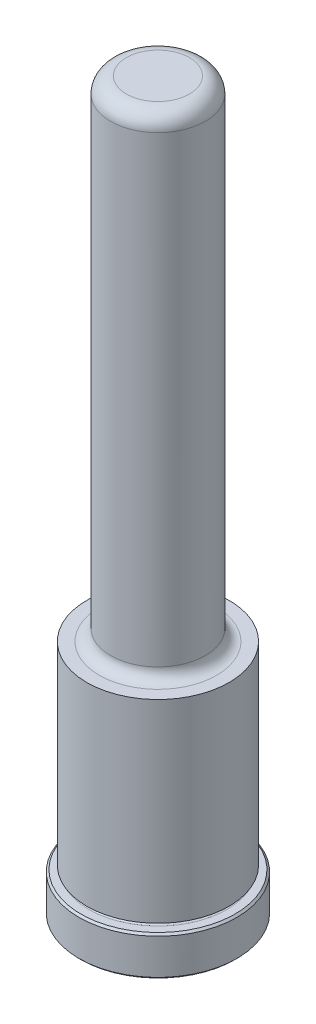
from build123d import *

# Parameters (mm, degrees)
CHAMFER1_SIZE = 0.381
FILLET1_R     = 3.175


with BuildPart() as part:
    # Sketch1 → Revolve1 (revolve)
    with BuildSketch(Plane(origin=(0, 0, 0), x_dir=(0, 0, -1), z_dir=(1, 0, 0)), mode=Mode.PRIVATE) as revolve1_sk:
        with BuildLine():
            Line((0, 0), (15.875, 0))
            Line((15.875, 0), (15.875, 7.9248))
            Line((15.875, 7.9248), (13.8938, 7.9248))
            ThreePointArc((13.8938, 7.9248), (13.5128, 8.3058), (13.8938, 8.6868))
            Line((13.8938, 8.6868), (14.3002, 8.6868))
            Line((14.3002, 8.6868), (14.3002, 47.625))
            Line((14.3002, 47.625), (11.7983, 47.625))
            ThreePointArc((11.7983, 47.625), (10.181853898, 48.294553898), (9.5123, 49.911))
            Line((9.5123, 49.911), (9.5123, 146.05))
            Line((9.5123, 146.05), (0, 146.05))
            Line((0, 146.05), (0, 0))
        make_face()
    revolve(revolve1_sk.sketch.rotate(Axis((0, 0, 0), (0, -1, 0)), 180), axis=Axis((0, 0, 0), (0, -1, 0)))

    # Chamfer1
    chamfer1_edges = [part.edges().sort_by_distance(p)[0] for p in [
        (0, 7.9248, -15.875),
        (0, 0, -15.875),
    ]]
    chamfer(chamfer1_edges, length=CHAMFER1_SIZE)

    # Fillet1
    fillet1_edges = [part.edges().sort_by_distance(p)[0] for p in [
        (0, 146.05, -9.5123),
    ]]
    fillet(fillet1_edges, radius=FILLET1_R)


solid = part.part
